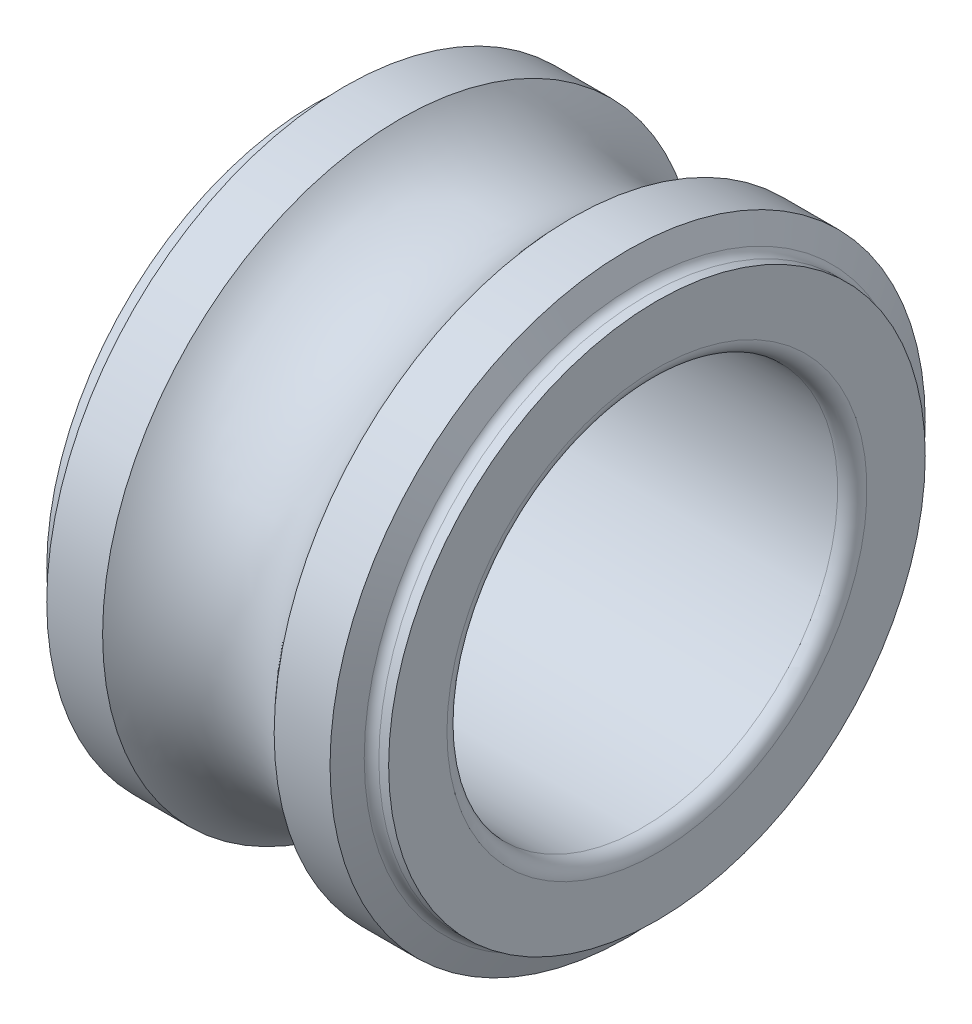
ISO-10303-21;
HEADER;
FILE_DESCRIPTION(('STEP AP214'),'2;1');
FILE_NAME('part.step','',(''),(''),'','','');
FILE_SCHEMA(('AUTOMOTIVE_DESIGN { 1 0 10303 214 1 1 1 1 }'));
ENDSEC;
DATA;
#1=APPLICATION_CONTEXT('core data for automotive mechanical design processes');
#2=APPLICATION_PROTOCOL_DEFINITION('international standard','automotive_design',2000,#1);
#3=PRODUCT_CONTEXT('',#1,'mechanical');
#4=PRODUCT('Part','Part','',(#3));
#5=PRODUCT_RELATED_PRODUCT_CATEGORY('part','',(#4));
#6=PRODUCT_DEFINITION_FORMATION('','',#4);
#7=PRODUCT_DEFINITION_CONTEXT('part definition',#1,'design');
#8=PRODUCT_DEFINITION('design','',#6,#7);
#9=PRODUCT_DEFINITION_SHAPE('','',#8);
#10=(LENGTH_UNIT() NAMED_UNIT(*) SI_UNIT(.MILLI.,.METRE.));
#11=(NAMED_UNIT(*) PLANE_ANGLE_UNIT() SI_UNIT($,.RADIAN.));
#12=(NAMED_UNIT(*) SI_UNIT($,.STERADIAN.) SOLID_ANGLE_UNIT());
#13=UNCERTAINTY_MEASURE_WITH_UNIT(LENGTH_MEASURE(1.E-05),#10,'distance_accuracy_value','');
#14=(GEOMETRIC_REPRESENTATION_CONTEXT(3) GLOBAL_UNCERTAINTY_ASSIGNED_CONTEXT((#13)) GLOBAL_UNIT_ASSIGNED_CONTEXT((#10,
#11,#12)) REPRESENTATION_CONTEXT('',''));
#15=CARTESIAN_POINT('',(0.,0.,0.));
#16=DIRECTION('',(0.,0.,1.));
#17=DIRECTION('',(1.,0.,0.));
#18=AXIS2_PLACEMENT_3D('',#15,#16,#17);
#19=CARTESIAN_POINT('',(6.79999999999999,0.,0.));
#20=DIRECTION('',(-1.,0.,0.));
#21=DIRECTION('',(0.,0.,1.));
#22=AXIS2_PLACEMENT_3D('',#19,#20,#21);
#23=TOROIDAL_SURFACE('',#22,5.69374999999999,0.2);
#24=CARTESIAN_POINT('',(6.61771243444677,0.,0.));
#25=DIRECTION('',(-1.,0.,0.));
#26=DIRECTION('',(0.,0.,1.));
#27=AXIS2_PLACEMENT_3D('',#24,#25,#26);
#28=CIRCLE('',#27,5.61146243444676);
#29=CARTESIAN_POINT('',(6.61771243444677,0.,5.61146243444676));
#30=VERTEX_POINT('',#29);
#31=EDGE_CURVE('E10',#30,#30,#28,.T.);
#32=ORIENTED_EDGE('',*,*,#31,.F.);
#33=EDGE_LOOP('',(#32));
#34=FACE_BOUND('',#33,.T.);
#35=CARTESIAN_POINT('',(6.79999999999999,0.,0.));
#36=DIRECTION('',(-1.,0.,0.));
#37=DIRECTION('',(0.,0.,1.));
#38=AXIS2_PLACEMENT_3D('',#35,#36,#37);
#39=CIRCLE('',#38,5.49374999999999);
#40=CARTESIAN_POINT('',(6.79999999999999,0.,5.49374999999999));
#41=VERTEX_POINT('',#40);
#42=EDGE_CURVE('E75',#41,#41,#39,.T.);
#43=ORIENTED_EDGE('',*,*,#42,.T.);
#44=EDGE_LOOP('',(#43));
#45=FACE_BOUND('',#44,.T.);
#46=ADVANCED_FACE('F29',(#34,#45),#23,.F.);
#47=CARTESIAN_POINT('',(6.61771243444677,0.,0.));
#48=DIRECTION('',(-1.,0.,0.));
#49=DIRECTION('',(0.,0.,1.));
#50=AXIS2_PLACEMENT_3D('',#47,#48,#49);
#51=CONICAL_SURFACE('',#50,5.61146243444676,1.14676528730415);
#52=CARTESIAN_POINT('',(6.39999999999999,0.,0.));
#53=DIRECTION('',(-1.,0.,0.));
#54=DIRECTION('',(0.,0.,1.));
#55=AXIS2_PLACEMENT_3D('',#52,#53,#54);
#56=CIRCLE('',#55,6.09374999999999);
#57=CARTESIAN_POINT('',(6.39999999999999,0.,6.09374999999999));
#58=VERTEX_POINT('',#57);
#59=EDGE_CURVE('E35',#58,#58,#56,.T.);
#60=ORIENTED_EDGE('',*,*,#59,.F.);
#61=EDGE_LOOP('',(#60));
#62=FACE_BOUND('',#61,.T.);
#63=ORIENTED_EDGE('',*,*,#31,.T.);
#64=EDGE_LOOP('',(#63));
#65=FACE_BOUND('',#64,.T.);
#66=ADVANCED_FACE('F148',(#62,#65),#51,.T.);
#67=CARTESIAN_POINT('',(-13.,0.,0.));
#68=DIRECTION('',(-1.,0.,0.));
#69=DIRECTION('',(0.,0.,1.));
#70=AXIS2_PLACEMENT_3D('',#67,#68,#69);
#71=CYLINDRICAL_SURFACE('',#70,6.09374999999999);
#72=CARTESIAN_POINT('',(5.25640568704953,0.,0.));
#73=DIRECTION('',(-1.,0.,0.));
#74=DIRECTION('',(0.,0.,1.));
#75=AXIS2_PLACEMENT_3D('',#72,#73,#74);
#76=CIRCLE('',#75,6.09374999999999);
#77=CARTESIAN_POINT('',(5.25640568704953,0.,6.09374999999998));
#78=VERTEX_POINT('',#77);
#79=EDGE_CURVE('E39',#78,#78,#76,.T.);
#80=ORIENTED_EDGE('',*,*,#79,.F.);
#81=EDGE_LOOP('',(#80));
#82=FACE_BOUND('',#81,.T.);
#83=ORIENTED_EDGE('',*,*,#59,.T.);
#84=EDGE_LOOP('',(#83));
#85=FACE_BOUND('',#84,.T.);
#86=ADVANCED_FACE('F143',(#82,#85),#71,.T.);
#87=CARTESIAN_POINT('',(3.49999999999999,0.,0.));
#88=DIRECTION('',(-1.,0.,0.));
#89=DIRECTION('',(0.,0.,1.));
#90=AXIS2_PLACEMENT_3D('',#87,#88,#89);
#91=TOROIDAL_SURFACE('',#90,7.5,2.25);
#92=CARTESIAN_POINT('',(1.74359431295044,0.,0.));
#93=DIRECTION('',(-1.,0.,0.));
#94=DIRECTION('',(0.,0.,1.));
#95=AXIS2_PLACEMENT_3D('',#92,#93,#94);
#96=CIRCLE('',#95,6.09374999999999);
#97=CARTESIAN_POINT('',(1.74359431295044,0.,6.09374999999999));
#98=VERTEX_POINT('',#97);
#99=EDGE_CURVE('E43',#98,#98,#96,.T.);
#100=ORIENTED_EDGE('',*,*,#99,.F.);
#101=EDGE_LOOP('',(#100));
#102=FACE_BOUND('',#101,.T.);
#103=ORIENTED_EDGE('',*,*,#79,.T.);
#104=EDGE_LOOP('',(#103));
#105=FACE_BOUND('',#104,.T.);
#106=ADVANCED_FACE('F137',(#102,#105),#91,.F.);
#107=CARTESIAN_POINT('',(-13.,0.,0.));
#108=DIRECTION('',(-1.,0.,0.));
#109=DIRECTION('',(0.,0.,1.));
#110=AXIS2_PLACEMENT_3D('',#107,#108,#109);
#111=CYLINDRICAL_SURFACE('',#110,6.09374999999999);
#112=CARTESIAN_POINT('',(0.599999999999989,0.,0.));
#113=DIRECTION('',(-1.,0.,0.));
#114=DIRECTION('',(0.,0.,1.));
#115=AXIS2_PLACEMENT_3D('',#112,#113,#114);
#116=CIRCLE('',#115,6.09374999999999);
#117=CARTESIAN_POINT('',(0.599999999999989,0.,6.09375));
#118=VERTEX_POINT('',#117);
#119=EDGE_CURVE('E48',#118,#118,#116,.T.);
#120=ORIENTED_EDGE('',*,*,#119,.F.);
#121=EDGE_LOOP('',(#120));
#122=FACE_BOUND('',#121,.T.);
#123=ORIENTED_EDGE('',*,*,#99,.T.);
#124=EDGE_LOOP('',(#123));
#125=FACE_BOUND('',#124,.T.);
#126=ADVANCED_FACE('F131',(#122,#125),#111,.T.);
#127=CARTESIAN_POINT('',(0.599999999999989,0.,0.));
#128=DIRECTION('',(1.,0.,0.));
#129=DIRECTION('',(0.,0.,-1.));
#130=AXIS2_PLACEMENT_3D('',#127,#128,#129);
#131=CONICAL_SURFACE('',#130,6.09374999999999,1.14676528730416);
#132=CARTESIAN_POINT('',(0.382287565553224,0.,0.));
#133=DIRECTION('',(-1.,0.,0.));
#134=DIRECTION('',(0.,0.,1.));
#135=AXIS2_PLACEMENT_3D('',#132,#133,#134);
#136=CIRCLE('',#135,5.61146243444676);
#137=CARTESIAN_POINT('',(0.382287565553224,0.,5.61146243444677));
#138=VERTEX_POINT('',#137);
#139=EDGE_CURVE('E51',#138,#138,#136,.T.);
#140=ORIENTED_EDGE('',*,*,#139,.F.);
#141=EDGE_LOOP('',(#140));
#142=FACE_BOUND('',#141,.T.);
#143=ORIENTED_EDGE('',*,*,#119,.T.);
#144=EDGE_LOOP('',(#143));
#145=FACE_BOUND('',#144,.T.);
#146=ADVANCED_FACE('F125',(#142,#145),#131,.T.);
#147=CARTESIAN_POINT('',(0.199999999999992,0.,0.));
#148=DIRECTION('',(-1.,0.,0.));
#149=DIRECTION('',(0.,0.,1.));
#150=AXIS2_PLACEMENT_3D('',#147,#148,#149);
#151=TOROIDAL_SURFACE('',#150,5.69374999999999,0.2);
#152=CARTESIAN_POINT('',(0.199999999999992,0.,0.));
#153=DIRECTION('',(-1.,0.,0.));
#154=DIRECTION('',(0.,0.,1.));
#155=AXIS2_PLACEMENT_3D('',#152,#153,#154);
#156=CIRCLE('',#155,5.49374999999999);
#157=CARTESIAN_POINT('',(0.199999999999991,0.,5.49374999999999));
#158=VERTEX_POINT('',#157);
#159=EDGE_CURVE('E54',#158,#158,#156,.T.);
#160=ORIENTED_EDGE('',*,*,#159,.F.);
#161=EDGE_LOOP('',(#160));
#162=FACE_BOUND('',#161,.T.);
#163=ORIENTED_EDGE('',*,*,#139,.T.);
#164=EDGE_LOOP('',(#163));
#165=FACE_BOUND('',#164,.T.);
#166=ADVANCED_FACE('F119',(#162,#165),#151,.F.);
#167=CARTESIAN_POINT('',(-13.,0.,0.));
#168=DIRECTION('',(-1.,0.,0.));
#169=DIRECTION('',(0.,0.,1.));
#170=AXIS2_PLACEMENT_3D('',#167,#168,#169);
#171=CYLINDRICAL_SURFACE('',#170,5.49374999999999);
#172=CARTESIAN_POINT('',(0.,0.,0.));
#173=DIRECTION('',(-1.,0.,0.));
#174=DIRECTION('',(0.,0.,1.));
#175=AXIS2_PLACEMENT_3D('',#172,#173,#174);
#176=CIRCLE('',#175,5.49374999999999);
#177=CARTESIAN_POINT('',(0.,0.,5.49374999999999));
#178=VERTEX_POINT('',#177);
#179=EDGE_CURVE('E57',#178,#178,#176,.T.);
#180=ORIENTED_EDGE('',*,*,#179,.F.);
#181=EDGE_LOOP('',(#180));
#182=FACE_BOUND('',#181,.T.);
#183=ORIENTED_EDGE('',*,*,#159,.T.);
#184=EDGE_LOOP('',(#183));
#185=FACE_BOUND('',#184,.T.);
#186=ADVANCED_FACE('F113',(#182,#185),#171,.T.);
#187=CARTESIAN_POINT('',(0.,4.30000000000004,0.));
#188=DIRECTION('',(1.,0.,0.));
#189=DIRECTION('',(0.,0.,-1.));
#190=AXIS2_PLACEMENT_3D('',#187,#188,#189);
#191=PLANE('',#190);
#192=CARTESIAN_POINT('',(0.,0.,0.));
#193=DIRECTION('',(-1.,0.,0.));
#194=DIRECTION('',(0.,0.,1.));
#195=AXIS2_PLACEMENT_3D('',#192,#193,#194);
#196=CIRCLE('',#195,4.3);
#197=CARTESIAN_POINT('',(0.,0.,4.3));
#198=VERTEX_POINT('',#197);
#199=EDGE_CURVE('E60',#198,#198,#196,.T.);
#200=ORIENTED_EDGE('',*,*,#199,.F.);
#201=EDGE_LOOP('',(#200));
#202=FACE_BOUND('',#201,.T.);
#203=ORIENTED_EDGE('',*,*,#179,.T.);
#204=EDGE_LOOP('',(#203));
#205=FACE_BOUND('',#204,.T.);
#206=ADVANCED_FACE('F107',(#202,#205),#191,.F.);
#207=CARTESIAN_POINT('',(0.299999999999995,0.,0.));
#208=DIRECTION('',(-1.,0.,0.));
#209=DIRECTION('',(0.,0.,1.));
#210=AXIS2_PLACEMENT_3D('',#207,#208,#209);
#211=TOROIDAL_SURFACE('',#210,4.3,0.3);
#212=CARTESIAN_POINT('',(0.299999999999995,0.,0.));
#213=DIRECTION('',(-1.,0.,0.));
#214=DIRECTION('',(0.,0.,1.));
#215=AXIS2_PLACEMENT_3D('',#212,#213,#214);
#216=CIRCLE('',#215,4.);
#217=CARTESIAN_POINT('',(0.299999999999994,0.,4.));
#218=VERTEX_POINT('',#217);
#219=EDGE_CURVE('E63',#218,#218,#216,.T.);
#220=ORIENTED_EDGE('',*,*,#219,.F.);
#221=EDGE_LOOP('',(#220));
#222=FACE_BOUND('',#221,.T.);
#223=ORIENTED_EDGE('',*,*,#199,.T.);
#224=EDGE_LOOP('',(#223));
#225=FACE_BOUND('',#224,.T.);
#226=ADVANCED_FACE('F101',(#222,#225),#211,.T.);
#227=CARTESIAN_POINT('',(-13.,0.,0.));
#228=DIRECTION('',(-1.,0.,0.));
#229=DIRECTION('',(0.,0.,1.));
#230=AXIS2_PLACEMENT_3D('',#227,#228,#229);
#231=CYLINDRICAL_SURFACE('',#230,4.);
#232=CARTESIAN_POINT('',(6.7,0.,0.));
#233=DIRECTION('',(-1.,0.,0.));
#234=DIRECTION('',(0.,0.,1.));
#235=AXIS2_PLACEMENT_3D('',#232,#233,#234);
#236=CIRCLE('',#235,4.);
#237=CARTESIAN_POINT('',(6.7,0.,4.));
#238=VERTEX_POINT('',#237);
#239=EDGE_CURVE('E66',#238,#238,#236,.T.);
#240=ORIENTED_EDGE('',*,*,#239,.F.);
#241=EDGE_LOOP('',(#240));
#242=FACE_BOUND('',#241,.T.);
#243=ORIENTED_EDGE('',*,*,#219,.T.);
#244=EDGE_LOOP('',(#243));
#245=FACE_BOUND('',#244,.T.);
#246=ADVANCED_FACE('F95',(#242,#245),#231,.F.);
#247=CARTESIAN_POINT('',(6.7,0.,0.));
#248=DIRECTION('',(-1.,0.,0.));
#249=DIRECTION('',(0.,0.,1.));
#250=AXIS2_PLACEMENT_3D('',#247,#248,#249);
#251=TOROIDAL_SURFACE('',#250,4.3,0.299999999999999);
#252=CARTESIAN_POINT('',(6.99999999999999,0.,0.));
#253=DIRECTION('',(-1.,0.,0.));
#254=DIRECTION('',(0.,0.,1.));
#255=AXIS2_PLACEMENT_3D('',#252,#253,#254);
#256=CIRCLE('',#255,4.3);
#257=CARTESIAN_POINT('',(6.99999999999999,0.,4.3));
#258=VERTEX_POINT('',#257);
#259=EDGE_CURVE('E69',#258,#258,#256,.T.);
#260=ORIENTED_EDGE('',*,*,#259,.F.);
#261=EDGE_LOOP('',(#260));
#262=FACE_BOUND('',#261,.T.);
#263=ORIENTED_EDGE('',*,*,#239,.T.);
#264=EDGE_LOOP('',(#263));
#265=FACE_BOUND('',#264,.T.);
#266=ADVANCED_FACE('F89',(#262,#265),#251,.T.);
#267=CARTESIAN_POINT('',(6.99999999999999,4.30000000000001,0.));
#268=DIRECTION('',(-1.,0.,0.));
#269=DIRECTION('',(0.,0.,1.));
#270=AXIS2_PLACEMENT_3D('',#267,#268,#269);
#271=PLANE('',#270);
#272=CARTESIAN_POINT('',(6.99999999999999,0.,0.));
#273=DIRECTION('',(-1.,0.,0.));
#274=DIRECTION('',(0.,0.,1.));
#275=AXIS2_PLACEMENT_3D('',#272,#273,#274);
#276=CIRCLE('',#275,5.49374999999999);
#277=CARTESIAN_POINT('',(6.99999999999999,0.,5.49374999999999));
#278=VERTEX_POINT('',#277);
#279=EDGE_CURVE('E72',#278,#278,#276,.T.);
#280=ORIENTED_EDGE('',*,*,#279,.F.);
#281=EDGE_LOOP('',(#280));
#282=FACE_BOUND('',#281,.T.);
#283=ORIENTED_EDGE('',*,*,#259,.T.);
#284=EDGE_LOOP('',(#283));
#285=FACE_BOUND('',#284,.T.);
#286=ADVANCED_FACE('F83',(#282,#285),#271,.F.);
#287=CARTESIAN_POINT('',(-13.,0.,0.));
#288=DIRECTION('',(-1.,0.,0.));
#289=DIRECTION('',(0.,0.,1.));
#290=AXIS2_PLACEMENT_3D('',#287,#288,#289);
#291=CYLINDRICAL_SURFACE('',#290,5.49374999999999);
#292=ORIENTED_EDGE('',*,*,#42,.F.);
#293=EDGE_LOOP('',(#292));
#294=FACE_BOUND('',#293,.T.);
#295=ORIENTED_EDGE('',*,*,#279,.T.);
#296=EDGE_LOOP('',(#295));
#297=FACE_BOUND('',#296,.T.);
#298=ADVANCED_FACE('F80',(#294,#297),#291,.T.);
#299=CLOSED_SHELL('',(#46,#66,#86,#106,#126,#146,#166,#186,#206,#226,#246,#266,#286,#298));
#300=MANIFOLD_SOLID_BREP('B2',#299);
#301=ADVANCED_BREP_SHAPE_REPRESENTATION('',(#18,#300),#14);
#302=SHAPE_DEFINITION_REPRESENTATION(#9,#301);
ENDSEC;
END-ISO-10303-21;
